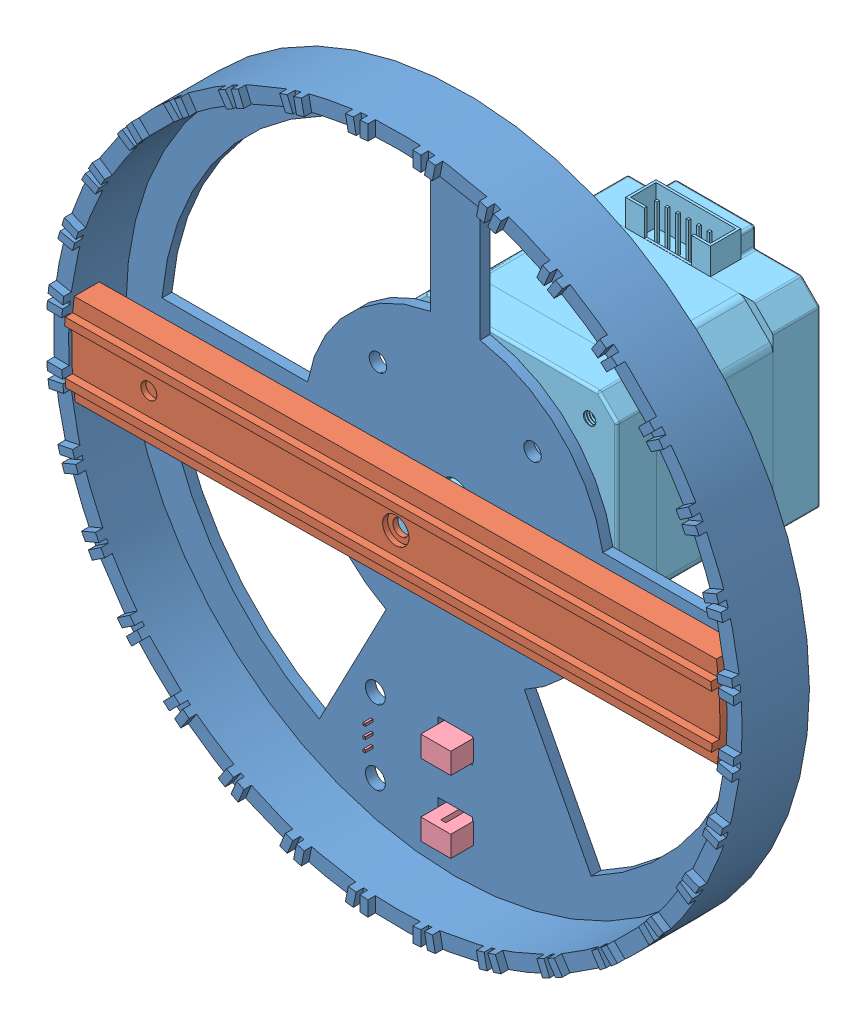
SolidWorks assembly Assemblage1.SLDASM, configuration Défaut (file format 9000). Lengths in mm.
Overall size (138 138 65.65).
5 component instances, 5 part files, 8 mates.
Components (placement in the parent):
- Pont tournant 1-1: Pont tournant 1.SLDPRT [Défaut] at (-38.9792 9.8413 133.25) size (138 138 15)
- Pont tournant 2-1: Pont tournant 2.SLDPRT [Défaut] at (-38.9792 9.8413 145.155) x (0.999942 0.010767 0) z (0 0 1) size (130 18.2 6.5)
- Pont tournant 3-1: Pont tournant 3.SLDPRT [Défaut] at (-88.4764 9.3083 135.155) size (3 3 8)
- LM393-1: LM393.SLDPRT [Défaut] at (-34.5292 70.4413 120.9903) x (-1 0 0) z (0 0 1) size (23.1 20.2 18.3)
- Nima 17 40x42x5mm-1: Nima 17 40x42x5mm.SLDPRT [Default] at (-38.9792 9.8413 90.605) x (1 0 0) z (0 1 0) size (42 62.15 47.3)
Mates (geometry in assembly coordinates):
- Coaxiale1: concentric aligned: cylinder of Pont tournant 1-1 through (-38.9792 9.8413 131.25) axis (0 0 1) radius 3; cylinder of Pont tournant 2-1 through (-38.9792 9.8413 140.155) axis (0 0 1) radius 1.6
- Coaxiale2: concentric aligned: cylinder of Pont tournant 2-1 through (-88.4764 9.3083 143.155) axis (0 0 -1) radius 1.6; cylinder of Pont tournant 3-1 through (-88.4764 9.3083 143.155) axis (0 0 -1) radius 1.5
- Coïncidente1: coincident anti-aligned: plane of Pont tournant 2-1 through (-38.9792 9.8413 143.155) normal (0 0 -1); plane of Pont tournant 3-1 through (-88.4764 9.3083 143.155) normal (0 0 1)
- Coaxiale8: concentric anti-aligned: cylinder of Pont tournant 1-1 through (-54.9792 -47.1087 131.25) axis (0 0 1) radius 2; cylinder of LM393-1 through (-54.9792 -47.1087 121.7403) axis (0 0 -1) radius 1.55
- Coaxiale11: concentric anti-aligned: cylinder of Pont tournant 1-1 through (-54.9792 -32.2087 131.25) axis (0 0 1) radius 2; cylinder of LM393-1 through (-54.9792 -32.2087 121.7403) axis (0 0 -1) radius 1.55
- Coaxiale12: concentric anti-aligned: cylinder of Pont tournant 1-1 through (-38.9792 9.8413 131.25) axis (0 0 1) radius 3; cylinder of Nima 17 40x42x5mm-1 through (-38.9792 9.8413 143.155) axis (0 0 -1) radius 2.5
- Coïncidente2: coincident anti-aligned: plane of Pont tournant 2-1 through (-38.9792 9.8413 143.155) normal (0 0 -1); plane of Nima 17 40x42x5mm-1 through (-38.9792 9.8413 143.155) normal (0 0 1)
- Coaxiale13: concentric aligned: cylinder of Pont tournant 1-1 through (-54.4792 25.3413 131.25) axis (0 0 1) radius 1.75; circle of Nima 17 40x42x5mm-1
